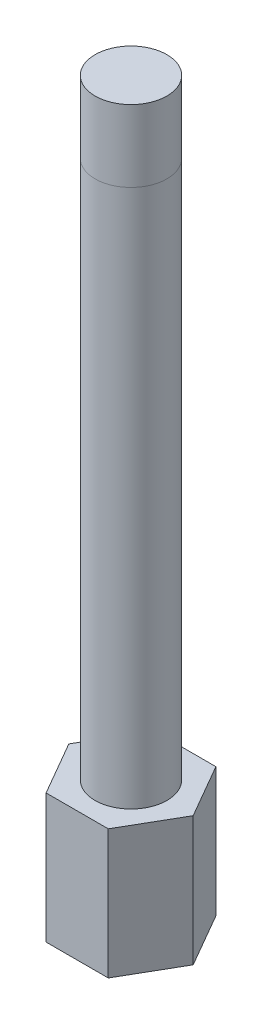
from build123d import *

# Parameters (mm, degrees)
BOSS_EXTRUDE1_DEPTH = 18
SKETCH2_R           = 5
BOSS_EXTRUDE2_DEPTH = 85


with BuildPart() as part:
    # Sketch1 → Boss-Extrude1 (new body)
    with BuildSketch(Plane(origin=(0, 0, 0), x_dir=(1, 0, 0), z_dir=(0, 1, 0))):
        Polygon((-8.660254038, 0), (-4.330127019, -7.5), (4.330127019, -7.5), (8.660254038, 0), (4.330127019, 7.5), (-4.330127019, 7.5), align=None)
    extrude(amount=BOSS_EXTRUDE1_DEPTH)

    # Sketch2 → Boss-Extrude2 (add)
    with BuildSketch(Plane(origin=(0, 18, 0), x_dir=(1, 0, 0), z_dir=(0, 1, 0))):
        with Locations(Location((0, 0, 0), (0, 0, 270))):
            Circle(SKETCH2_R)
    extrude(amount=BOSS_EXTRUDE2_DEPTH)


solid = part.part
